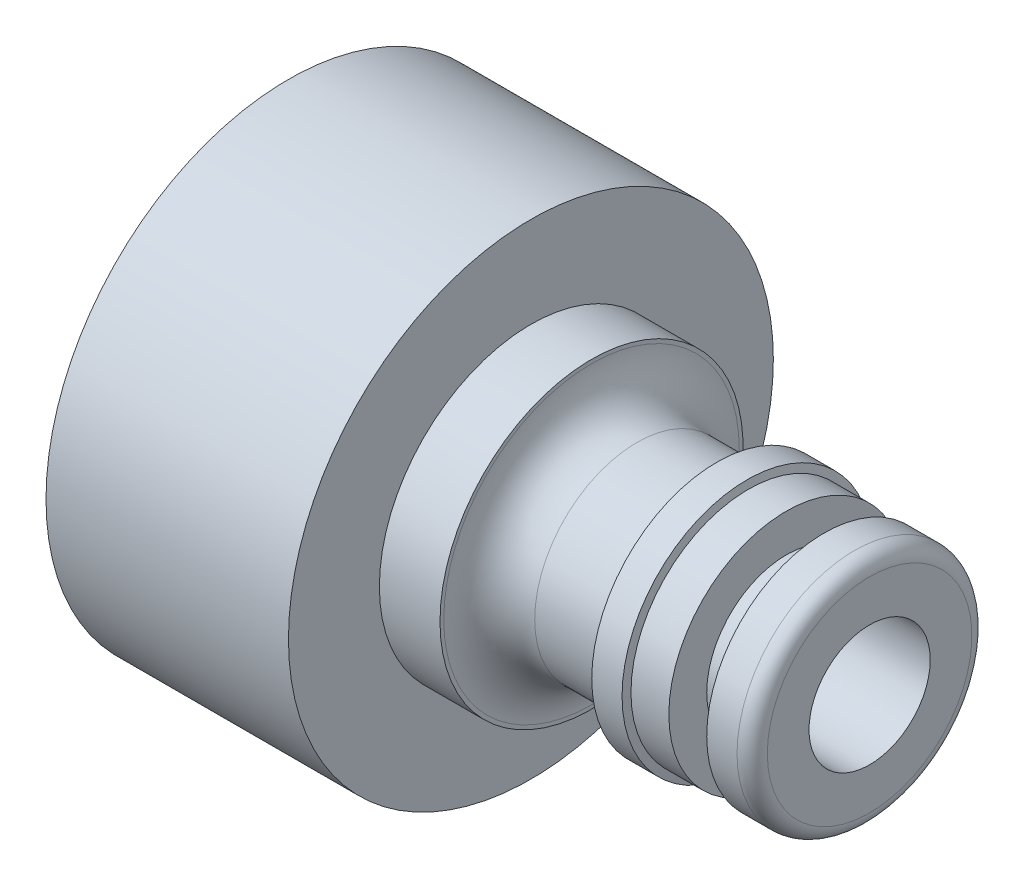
ISO-10303-21;
HEADER;
FILE_DESCRIPTION(('STEP AP214'),'2;1');
FILE_NAME('part.step','',(''),(''),'','','');
FILE_SCHEMA(('AUTOMOTIVE_DESIGN { 1 0 10303 214 1 1 1 1 }'));
ENDSEC;
DATA;
#1=APPLICATION_CONTEXT('core data for automotive mechanical design processes');
#2=APPLICATION_PROTOCOL_DEFINITION('international standard','automotive_design',2000,#1);
#3=PRODUCT_CONTEXT('',#1,'mechanical');
#4=PRODUCT('Part','Part','',(#3));
#5=PRODUCT_RELATED_PRODUCT_CATEGORY('part','',(#4));
#6=PRODUCT_DEFINITION_FORMATION('','',#4);
#7=PRODUCT_DEFINITION_CONTEXT('part definition',#1,'design');
#8=PRODUCT_DEFINITION('design','',#6,#7);
#9=PRODUCT_DEFINITION_SHAPE('','',#8);
#10=(LENGTH_UNIT() NAMED_UNIT(*) SI_UNIT(.MILLI.,.METRE.));
#11=(NAMED_UNIT(*) PLANE_ANGLE_UNIT() SI_UNIT($,.RADIAN.));
#12=(NAMED_UNIT(*) SI_UNIT($,.STERADIAN.) SOLID_ANGLE_UNIT());
#13=UNCERTAINTY_MEASURE_WITH_UNIT(LENGTH_MEASURE(1.E-05),#10,'distance_accuracy_value','');
#14=(GEOMETRIC_REPRESENTATION_CONTEXT(3) GLOBAL_UNCERTAINTY_ASSIGNED_CONTEXT((#13)) GLOBAL_UNIT_ASSIGNED_CONTEXT((#10,
#11,#12)) REPRESENTATION_CONTEXT('',''));
#15=CARTESIAN_POINT('',(0.,0.,0.));
#16=DIRECTION('',(0.,0.,1.));
#17=DIRECTION('',(1.,0.,0.));
#18=AXIS2_PLACEMENT_3D('',#15,#16,#17);
#19=CARTESIAN_POINT('',(0.,0.,0.));
#20=DIRECTION('',(1.,0.,0.));
#21=DIRECTION('',(0.,0.,-1.));
#22=AXIS2_PLACEMENT_3D('',#19,#20,#21);
#23=CYLINDRICAL_SURFACE('',#22,4.);
#24=CARTESIAN_POINT('',(38.3526539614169,0.,0.));
#25=DIRECTION('',(1.,0.,0.));
#26=DIRECTION('',(0.,0.,-1.));
#27=AXIS2_PLACEMENT_3D('',#24,#25,#26);
#28=CIRCLE('',#27,4.);
#29=CARTESIAN_POINT('',(38.3526539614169,0.,-4.));
#30=VERTEX_POINT('',#29);
#31=EDGE_CURVE('E103',#30,#30,#28,.T.);
#32=ORIENTED_EDGE('',*,*,#31,.T.);
#33=EDGE_LOOP('',(#32));
#34=FACE_BOUND('',#33,.T.);
#35=CARTESIAN_POINT('',(12.,0.,0.));
#36=DIRECTION('',(-1.,0.,0.));
#37=DIRECTION('',(0.,0.,1.));
#38=AXIS2_PLACEMENT_3D('',#35,#36,#37);
#39=CIRCLE('',#38,4.);
#40=CARTESIAN_POINT('',(12.,0.,4.));
#41=VERTEX_POINT('',#40);
#42=EDGE_CURVE('E51',#41,#41,#39,.F.);
#43=ORIENTED_EDGE('',*,*,#42,.F.);
#44=EDGE_LOOP('',(#43));
#45=FACE_BOUND('',#44,.T.);
#46=ADVANCED_FACE('F47',(#34,#45),#23,.F.);
#47=CARTESIAN_POINT('',(38.3526539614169,6.74999999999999,0.));
#48=DIRECTION('',(-1.,0.,0.));
#49=DIRECTION('',(0.,0.,1.));
#50=AXIS2_PLACEMENT_3D('',#47,#48,#49);
#51=PLANE('',#50);
#52=ORIENTED_EDGE('',*,*,#31,.F.);
#53=EDGE_LOOP('',(#52));
#54=FACE_BOUND('',#53,.T.);
#55=CARTESIAN_POINT('',(38.3526539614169,0.,0.));
#56=DIRECTION('',(-1.,0.,0.));
#57=DIRECTION('',(0.,0.,1.));
#58=AXIS2_PLACEMENT_3D('',#55,#56,#57);
#59=CIRCLE('',#58,6.74999999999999);
#60=CARTESIAN_POINT('',(38.3526539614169,0.,6.74999999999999));
#61=VERTEX_POINT('',#60);
#62=EDGE_CURVE('E12',#61,#61,#59,.T.);
#63=ORIENTED_EDGE('',*,*,#62,.F.);
#64=EDGE_LOOP('',(#63));
#65=FACE_BOUND('',#64,.T.);
#66=ADVANCED_FACE('F49',(#54,#65),#51,.F.);
#67=CARTESIAN_POINT('',(37.3526539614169,0.,0.));
#68=DIRECTION('',(-1.,0.,0.));
#69=DIRECTION('',(0.,0.,1.));
#70=AXIS2_PLACEMENT_3D('',#67,#68,#69);
#71=TOROIDAL_SURFACE('',#70,6.75,1.);
#72=CARTESIAN_POINT('',(37.3526539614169,0.,0.));
#73=DIRECTION('',(-1.,0.,0.));
#74=DIRECTION('',(0.,0.,1.));
#75=AXIS2_PLACEMENT_3D('',#72,#73,#74);
#76=CIRCLE('',#75,7.75);
#77=CARTESIAN_POINT('',(37.3526539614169,0.,7.75));
#78=VERTEX_POINT('',#77);
#79=EDGE_CURVE('E55',#78,#78,#76,.T.);
#80=ORIENTED_EDGE('',*,*,#79,.F.);
#81=EDGE_LOOP('',(#80));
#82=FACE_BOUND('',#81,.T.);
#83=ORIENTED_EDGE('',*,*,#62,.T.);
#84=EDGE_LOOP('',(#83));
#85=FACE_BOUND('',#84,.T.);
#86=ADVANCED_FACE('F124',(#82,#85),#71,.T.);
#87=CARTESIAN_POINT('',(0.,0.,0.));
#88=DIRECTION('',(-1.,0.,0.));
#89=DIRECTION('',(0.,0.,1.));
#90=AXIS2_PLACEMENT_3D('',#87,#88,#89);
#91=CYLINDRICAL_SURFACE('',#90,7.75);
#92=CARTESIAN_POINT('',(35.3526539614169,0.,0.));
#93=DIRECTION('',(-1.,0.,0.));
#94=DIRECTION('',(0.,0.,1.));
#95=AXIS2_PLACEMENT_3D('',#92,#93,#94);
#96=CIRCLE('',#95,7.75);
#97=CARTESIAN_POINT('',(35.3526539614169,0.,7.75));
#98=VERTEX_POINT('',#97);
#99=EDGE_CURVE('E59',#98,#98,#96,.T.);
#100=ORIENTED_EDGE('',*,*,#99,.F.);
#101=EDGE_LOOP('',(#100));
#102=FACE_BOUND('',#101,.T.);
#103=ORIENTED_EDGE('',*,*,#79,.T.);
#104=EDGE_LOOP('',(#103));
#105=FACE_BOUND('',#104,.T.);
#106=ADVANCED_FACE('F185',(#102,#105),#91,.T.);
#107=CARTESIAN_POINT('',(35.3526539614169,5.25,0.));
#108=DIRECTION('',(1.,0.,0.));
#109=DIRECTION('',(0.,0.,-1.));
#110=AXIS2_PLACEMENT_3D('',#107,#108,#109);
#111=PLANE('',#110);
#112=CARTESIAN_POINT('',(35.3526539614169,0.,0.));
#113=DIRECTION('',(-1.,0.,0.));
#114=DIRECTION('',(0.,0.,1.));
#115=AXIS2_PLACEMENT_3D('',#112,#113,#114);
#116=CIRCLE('',#115,5.25);
#117=CARTESIAN_POINT('',(35.3526539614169,0.,5.25));
#118=VERTEX_POINT('',#117);
#119=EDGE_CURVE('E64',#118,#118,#116,.T.);
#120=ORIENTED_EDGE('',*,*,#119,.F.);
#121=EDGE_LOOP('',(#120));
#122=FACE_BOUND('',#121,.T.);
#123=ORIENTED_EDGE('',*,*,#99,.T.);
#124=EDGE_LOOP('',(#123));
#125=FACE_BOUND('',#124,.T.);
#126=ADVANCED_FACE('F181',(#122,#125),#111,.F.);
#127=CARTESIAN_POINT('',(0.,0.,0.));
#128=DIRECTION('',(-1.,0.,0.));
#129=DIRECTION('',(0.,0.,1.));
#130=AXIS2_PLACEMENT_3D('',#127,#128,#129);
#131=CYLINDRICAL_SURFACE('',#130,5.25);
#132=CARTESIAN_POINT('',(32.8526539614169,0.,0.));
#133=DIRECTION('',(-1.,0.,0.));
#134=DIRECTION('',(0.,0.,1.));
#135=AXIS2_PLACEMENT_3D('',#132,#133,#134);
#136=CIRCLE('',#135,5.25);
#137=CARTESIAN_POINT('',(32.8526539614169,0.,5.25));
#138=VERTEX_POINT('',#137);
#139=EDGE_CURVE('E67',#138,#138,#136,.T.);
#140=ORIENTED_EDGE('',*,*,#139,.F.);
#141=EDGE_LOOP('',(#140));
#142=FACE_BOUND('',#141,.T.);
#143=ORIENTED_EDGE('',*,*,#119,.T.);
#144=EDGE_LOOP('',(#143));
#145=FACE_BOUND('',#144,.T.);
#146=ADVANCED_FACE('F177',(#142,#145),#131,.T.);
#147=CARTESIAN_POINT('',(32.8526539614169,7.75,0.));
#148=DIRECTION('',(-1.,0.,0.));
#149=DIRECTION('',(0.,0.,1.));
#150=AXIS2_PLACEMENT_3D('',#147,#148,#149);
#151=PLANE('',#150);
#152=CARTESIAN_POINT('',(32.8526539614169,0.,0.));
#153=DIRECTION('',(-1.,0.,0.));
#154=DIRECTION('',(0.,0.,1.));
#155=AXIS2_PLACEMENT_3D('',#152,#153,#154);
#156=CIRCLE('',#155,7.75);
#157=CARTESIAN_POINT('',(32.8526539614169,0.,7.75));
#158=VERTEX_POINT('',#157);
#159=EDGE_CURVE('E70',#158,#158,#156,.T.);
#160=ORIENTED_EDGE('',*,*,#159,.F.);
#161=EDGE_LOOP('',(#160));
#162=FACE_BOUND('',#161,.T.);
#163=ORIENTED_EDGE('',*,*,#139,.T.);
#164=EDGE_LOOP('',(#163));
#165=FACE_BOUND('',#164,.T.);
#166=ADVANCED_FACE('F173',(#162,#165),#151,.F.);
#167=CARTESIAN_POINT('',(0.,0.,0.));
#168=DIRECTION('',(-1.,0.,0.));
#169=DIRECTION('',(0.,0.,1.));
#170=AXIS2_PLACEMENT_3D('',#167,#168,#169);
#171=CYLINDRICAL_SURFACE('',#170,7.75);
#172=CARTESIAN_POINT('',(30.3526539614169,0.,0.));
#173=DIRECTION('',(-1.,0.,0.));
#174=DIRECTION('',(0.,0.,1.));
#175=AXIS2_PLACEMENT_3D('',#172,#173,#174);
#176=CIRCLE('',#175,7.75);
#177=CARTESIAN_POINT('',(30.3526539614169,0.,7.75));
#178=VERTEX_POINT('',#177);
#179=EDGE_CURVE('E73',#178,#178,#176,.T.);
#180=ORIENTED_EDGE('',*,*,#179,.F.);
#181=EDGE_LOOP('',(#180));
#182=FACE_BOUND('',#181,.T.);
#183=ORIENTED_EDGE('',*,*,#159,.T.);
#184=EDGE_LOOP('',(#183));
#185=FACE_BOUND('',#184,.T.);
#186=ADVANCED_FACE('F169',(#182,#185),#171,.T.);
#187=CARTESIAN_POINT('',(30.3526539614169,0.,0.));
#188=DIRECTION('',(-1.,0.,0.));
#189=DIRECTION('',(0.,0.,1.));
#190=AXIS2_PLACEMENT_3D('',#187,#188,#189);
#191=CONICAL_SURFACE('',#190,7.75,1.39626340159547);
#192=CARTESIAN_POINT('',(30.2644904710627,0.,0.));
#193=DIRECTION('',(-1.,0.,0.));
#194=DIRECTION('',(0.,0.,1.));
#195=AXIS2_PLACEMENT_3D('',#192,#193,#194);
#196=CIRCLE('',#195,8.25);
#197=CARTESIAN_POINT('',(30.2644904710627,0.,8.25));
#198=VERTEX_POINT('',#197);
#199=EDGE_CURVE('E76',#198,#198,#196,.T.);
#200=ORIENTED_EDGE('',*,*,#199,.F.);
#201=EDGE_LOOP('',(#200));
#202=FACE_BOUND('',#201,.T.);
#203=ORIENTED_EDGE('',*,*,#179,.T.);
#204=EDGE_LOOP('',(#203));
#205=FACE_BOUND('',#204,.T.);
#206=ADVANCED_FACE('F165',(#202,#205),#191,.T.);
#207=CARTESIAN_POINT('',(0.,0.,0.));
#208=DIRECTION('',(-1.,0.,0.));
#209=DIRECTION('',(0.,0.,1.));
#210=AXIS2_PLACEMENT_3D('',#207,#208,#209);
#211=CYLINDRICAL_SURFACE('',#210,8.25);
#212=CARTESIAN_POINT('',(28.2644904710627,0.,0.));
#213=DIRECTION('',(-1.,0.,0.));
#214=DIRECTION('',(0.,0.,1.));
#215=AXIS2_PLACEMENT_3D('',#212,#213,#214);
#216=CIRCLE('',#215,8.25);
#217=CARTESIAN_POINT('',(28.2644904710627,0.,8.25));
#218=VERTEX_POINT('',#217);
#219=EDGE_CURVE('E79',#218,#218,#216,.T.);
#220=ORIENTED_EDGE('',*,*,#219,.F.);
#221=EDGE_LOOP('',(#220));
#222=FACE_BOUND('',#221,.T.);
#223=ORIENTED_EDGE('',*,*,#199,.T.);
#224=EDGE_LOOP('',(#223));
#225=FACE_BOUND('',#224,.T.);
#226=ADVANCED_FACE('F161',(#222,#225),#211,.T.);
#227=CARTESIAN_POINT('',(28.2644904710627,0.,0.));
#228=DIRECTION('',(1.,0.,0.));
#229=DIRECTION('',(0.,0.,-1.));
#230=AXIS2_PLACEMENT_3D('',#227,#228,#229);
#231=CONICAL_SURFACE('',#230,8.25,1.39626340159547);
#232=CARTESIAN_POINT('',(28.,0.,0.));
#233=DIRECTION('',(-1.,0.,0.));
#234=DIRECTION('',(0.,0.,1.));
#235=AXIS2_PLACEMENT_3D('',#232,#233,#234);
#236=CIRCLE('',#235,6.75);
#237=CARTESIAN_POINT('',(28.,0.,6.75));
#238=VERTEX_POINT('',#237);
#239=EDGE_CURVE('E82',#238,#238,#236,.T.);
#240=ORIENTED_EDGE('',*,*,#239,.F.);
#241=EDGE_LOOP('',(#240));
#242=FACE_BOUND('',#241,.T.);
#243=ORIENTED_EDGE('',*,*,#219,.T.);
#244=EDGE_LOOP('',(#243));
#245=FACE_BOUND('',#244,.T.);
#246=ADVANCED_FACE('F157',(#242,#245),#231,.T.);
#247=CARTESIAN_POINT('',(0.,0.,0.));
#248=DIRECTION('',(-1.,0.,0.));
#249=DIRECTION('',(0.,0.,1.));
#250=AXIS2_PLACEMENT_3D('',#247,#248,#249);
#251=CYLINDRICAL_SURFACE('',#250,6.75);
#252=CARTESIAN_POINT('',(23.,0.,0.));
#253=DIRECTION('',(-1.,0.,0.));
#254=DIRECTION('',(0.,0.,1.));
#255=AXIS2_PLACEMENT_3D('',#252,#253,#254);
#256=CIRCLE('',#255,6.75);
#257=CARTESIAN_POINT('',(23.,0.,6.75));
#258=VERTEX_POINT('',#257);
#259=EDGE_CURVE('E85',#258,#258,#256,.T.);
#260=ORIENTED_EDGE('',*,*,#259,.F.);
#261=EDGE_LOOP('',(#260));
#262=FACE_BOUND('',#261,.T.);
#263=ORIENTED_EDGE('',*,*,#239,.T.);
#264=EDGE_LOOP('',(#263));
#265=FACE_BOUND('',#264,.T.);
#266=ADVANCED_FACE('F153',(#262,#265),#251,.T.);
#267=CARTESIAN_POINT('',(23.,0.,0.));
#268=DIRECTION('',(-1.,0.,0.));
#269=DIRECTION('',(0.,0.,1.));
#270=AXIS2_PLACEMENT_3D('',#267,#268,#269);
#271=TOROIDAL_SURFACE('',#270,9.75,3.);
#272=CARTESIAN_POINT('',(20.,0.,0.));
#273=DIRECTION('',(-1.,0.,0.));
#274=DIRECTION('',(0.,0.,1.));
#275=AXIS2_PLACEMENT_3D('',#272,#273,#274);
#276=CIRCLE('',#275,9.75000000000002);
#277=CARTESIAN_POINT('',(20.,0.,9.75000000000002));
#278=VERTEX_POINT('',#277);
#279=EDGE_CURVE('E88',#278,#278,#276,.T.);
#280=ORIENTED_EDGE('',*,*,#279,.F.);
#281=EDGE_LOOP('',(#280));
#282=FACE_BOUND('',#281,.T.);
#283=ORIENTED_EDGE('',*,*,#259,.T.);
#284=EDGE_LOOP('',(#283));
#285=FACE_BOUND('',#284,.T.);
#286=ADVANCED_FACE('F149',(#282,#285),#271,.F.);
#287=CARTESIAN_POINT('',(20.,10.,0.));
#288=DIRECTION('',(-1.,0.,0.));
#289=DIRECTION('',(0.,0.,1.));
#290=AXIS2_PLACEMENT_3D('',#287,#288,#289);
#291=PLANE('',#290);
#292=CARTESIAN_POINT('',(20.,0.,0.));
#293=DIRECTION('',(-1.,0.,0.));
#294=DIRECTION('',(0.,0.,1.));
#295=AXIS2_PLACEMENT_3D('',#292,#293,#294);
#296=CIRCLE('',#295,10.);
#297=CARTESIAN_POINT('',(20.,0.,10.));
#298=VERTEX_POINT('',#297);
#299=EDGE_CURVE('E91',#298,#298,#296,.T.);
#300=ORIENTED_EDGE('',*,*,#299,.F.);
#301=EDGE_LOOP('',(#300));
#302=FACE_BOUND('',#301,.T.);
#303=ORIENTED_EDGE('',*,*,#279,.T.);
#304=EDGE_LOOP('',(#303));
#305=FACE_BOUND('',#304,.T.);
#306=ADVANCED_FACE('F145',(#302,#305),#291,.F.);
#307=CARTESIAN_POINT('',(0.,0.,0.));
#308=DIRECTION('',(-1.,0.,0.));
#309=DIRECTION('',(0.,0.,1.));
#310=AXIS2_PLACEMENT_3D('',#307,#308,#309);
#311=CYLINDRICAL_SURFACE('',#310,10.);
#312=CARTESIAN_POINT('',(16.,0.,0.));
#313=DIRECTION('',(-1.,0.,0.));
#314=DIRECTION('',(0.,0.,1.));
#315=AXIS2_PLACEMENT_3D('',#312,#313,#314);
#316=CIRCLE('',#315,10.);
#317=CARTESIAN_POINT('',(16.,0.,10.));
#318=VERTEX_POINT('',#317);
#319=EDGE_CURVE('E94',#318,#318,#316,.T.);
#320=ORIENTED_EDGE('',*,*,#319,.F.);
#321=EDGE_LOOP('',(#320));
#322=FACE_BOUND('',#321,.T.);
#323=ORIENTED_EDGE('',*,*,#299,.T.);
#324=EDGE_LOOP('',(#323));
#325=FACE_BOUND('',#324,.T.);
#326=ADVANCED_FACE('F141',(#322,#325),#311,.T.);
#327=CARTESIAN_POINT('',(16.,16.,0.));
#328=DIRECTION('',(-1.,0.,0.));
#329=DIRECTION('',(0.,0.,1.));
#330=AXIS2_PLACEMENT_3D('',#327,#328,#329);
#331=PLANE('',#330);
#332=CARTESIAN_POINT('',(16.,0.,0.));
#333=DIRECTION('',(-1.,0.,0.));
#334=DIRECTION('',(0.,0.,1.));
#335=AXIS2_PLACEMENT_3D('',#332,#333,#334);
#336=CIRCLE('',#335,16.);
#337=CARTESIAN_POINT('',(16.,0.,16.));
#338=VERTEX_POINT('',#337);
#339=EDGE_CURVE('E97',#338,#338,#336,.T.);
#340=ORIENTED_EDGE('',*,*,#339,.F.);
#341=EDGE_LOOP('',(#340));
#342=FACE_BOUND('',#341,.T.);
#343=ORIENTED_EDGE('',*,*,#319,.T.);
#344=EDGE_LOOP('',(#343));
#345=FACE_BOUND('',#344,.T.);
#346=ADVANCED_FACE('F137',(#342,#345),#331,.F.);
#347=CARTESIAN_POINT('',(0.,0.,0.));
#348=DIRECTION('',(-1.,0.,0.));
#349=DIRECTION('',(0.,0.,1.));
#350=AXIS2_PLACEMENT_3D('',#347,#348,#349);
#351=CYLINDRICAL_SURFACE('',#350,16.);
#352=CARTESIAN_POINT('',(0.,0.,0.));
#353=DIRECTION('',(-1.,0.,0.));
#354=DIRECTION('',(0.,0.,1.));
#355=AXIS2_PLACEMENT_3D('',#352,#353,#354);
#356=CIRCLE('',#355,16.);
#357=CARTESIAN_POINT('',(0.,0.,16.));
#358=VERTEX_POINT('',#357);
#359=EDGE_CURVE('E100',#358,#358,#356,.T.);
#360=ORIENTED_EDGE('',*,*,#359,.F.);
#361=EDGE_LOOP('',(#360));
#362=FACE_BOUND('',#361,.T.);
#363=ORIENTED_EDGE('',*,*,#339,.T.);
#364=EDGE_LOOP('',(#363));
#365=FACE_BOUND('',#364,.T.);
#366=ADVANCED_FACE('F133',(#362,#365),#351,.T.);
#367=CARTESIAN_POINT('',(0.,0.,0.));
#368=DIRECTION('',(1.,0.,0.));
#369=DIRECTION('',(0.,0.,-1.));
#370=AXIS2_PLACEMENT_3D('',#367,#368,#369);
#371=PLANE('',#370);
#372=CARTESIAN_POINT('',(0.,0.,0.));
#373=DIRECTION('',(-1.,0.,0.));
#374=DIRECTION('',(0.,0.,1.));
#375=AXIS2_PLACEMENT_3D('',#372,#373,#374);
#376=CIRCLE('',#375,12.25);
#377=CARTESIAN_POINT('',(0.,0.,12.25));
#378=VERTEX_POINT('',#377);
#379=EDGE_CURVE('E106',#378,#378,#376,.T.);
#380=ORIENTED_EDGE('',*,*,#379,.F.);
#381=EDGE_LOOP('',(#380));
#382=FACE_BOUND('',#381,.T.);
#383=ORIENTED_EDGE('',*,*,#359,.T.);
#384=EDGE_LOOP('',(#383));
#385=FACE_BOUND('',#384,.T.);
#386=ADVANCED_FACE('F130',(#382,#385),#371,.F.);
#387=CARTESIAN_POINT('',(12.,0.,0.));
#388=DIRECTION('',(-1.,0.,0.));
#389=DIRECTION('',(0.,0.,1.));
#390=AXIS2_PLACEMENT_3D('',#387,#388,#389);
#391=PLANE('',#390);
#392=CARTESIAN_POINT('',(12.,0.,0.));
#393=DIRECTION('',(-1.,0.,0.));
#394=DIRECTION('',(0.,0.,1.));
#395=AXIS2_PLACEMENT_3D('',#392,#393,#394);
#396=CIRCLE('',#395,12.25);
#397=CARTESIAN_POINT('',(12.,0.,12.25));
#398=VERTEX_POINT('',#397);
#399=EDGE_CURVE('E109',#398,#398,#396,.T.);
#400=ORIENTED_EDGE('',*,*,#399,.T.);
#401=EDGE_LOOP('',(#400));
#402=FACE_BOUND('',#401,.T.);
#403=ORIENTED_EDGE('',*,*,#42,.T.);
#404=EDGE_LOOP('',(#403));
#405=FACE_BOUND('',#404,.T.);
#406=ADVANCED_FACE('F116',(#402,#405),#391,.T.);
#407=CARTESIAN_POINT('',(12.,0.,0.));
#408=DIRECTION('',(-1.,0.,0.));
#409=DIRECTION('',(0.,0.,1.));
#410=AXIS2_PLACEMENT_3D('',#407,#408,#409);
#411=CYLINDRICAL_SURFACE('',#410,12.25);
#412=ORIENTED_EDGE('',*,*,#399,.F.);
#413=EDGE_LOOP('',(#412));
#414=FACE_BOUND('',#413,.T.);
#415=ORIENTED_EDGE('',*,*,#379,.T.);
#416=EDGE_LOOP('',(#415));
#417=FACE_BOUND('',#416,.T.);
#418=ADVANCED_FACE('F128',(#414,#417),#411,.F.);
#419=CLOSED_SHELL('',(#46,#66,#86,#106,#126,#146,#166,#186,#206,#226,#246,#266,#286,#306,#326,
#346,#366,#386,#406,#418));
#420=MANIFOLD_SOLID_BREP('B2',#419);
#421=ADVANCED_BREP_SHAPE_REPRESENTATION('',(#18,#420),#14);
#422=SHAPE_DEFINITION_REPRESENTATION(#9,#421);
ENDSEC;
END-ISO-10303-21;
